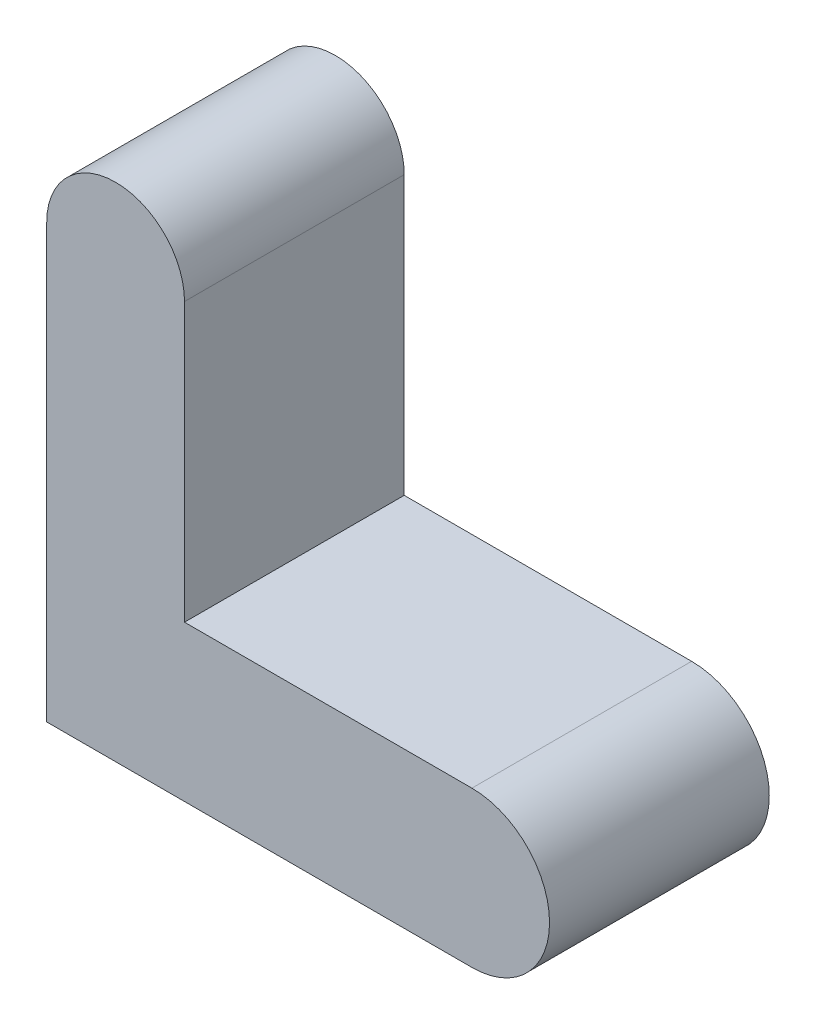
ISO-10303-21;
HEADER;
FILE_DESCRIPTION(('STEP AP214'),'2;1');
FILE_NAME('part.step','',(''),(''),'','','');
FILE_SCHEMA(('AUTOMOTIVE_DESIGN { 1 0 10303 214 1 1 1 1 }'));
ENDSEC;
DATA;
#1=APPLICATION_CONTEXT('core data for automotive mechanical design processes');
#2=APPLICATION_PROTOCOL_DEFINITION('international standard','automotive_design',2000,#1);
#3=PRODUCT_CONTEXT('',#1,'mechanical');
#4=PRODUCT('Part','Part','',(#3));
#5=PRODUCT_RELATED_PRODUCT_CATEGORY('part','',(#4));
#6=PRODUCT_DEFINITION_FORMATION('','',#4);
#7=PRODUCT_DEFINITION_CONTEXT('part definition',#1,'design');
#8=PRODUCT_DEFINITION('design','',#6,#7);
#9=PRODUCT_DEFINITION_SHAPE('','',#8);
#10=(LENGTH_UNIT() NAMED_UNIT(*) SI_UNIT(.MILLI.,.METRE.));
#11=(NAMED_UNIT(*) PLANE_ANGLE_UNIT() SI_UNIT($,.RADIAN.));
#12=(NAMED_UNIT(*) SI_UNIT($,.STERADIAN.) SOLID_ANGLE_UNIT());
#13=UNCERTAINTY_MEASURE_WITH_UNIT(LENGTH_MEASURE(1.E-05),#10,'distance_accuracy_value','');
#14=(GEOMETRIC_REPRESENTATION_CONTEXT(3) GLOBAL_UNCERTAINTY_ASSIGNED_CONTEXT((#13)) GLOBAL_UNIT_ASSIGNED_CONTEXT((#10,
#11,#12)) REPRESENTATION_CONTEXT('',''));
#15=CARTESIAN_POINT('',(0.,0.,0.));
#16=DIRECTION('',(0.,0.,1.));
#17=DIRECTION('',(1.,0.,0.));
#18=AXIS2_PLACEMENT_3D('',#15,#16,#17);
#19=CARTESIAN_POINT('',(45.1262891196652,0.,105.));
#20=DIRECTION('',(0.,0.,-1.));
#21=DIRECTION('',(-1.,0.,0.));
#22=AXIS2_PLACEMENT_3D('',#19,#20,#21);
#23=CYLINDRICAL_SURFACE('',#22,19.4348844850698);
#24=CARTESIAN_POINT('',(45.1262891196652,0.,50.));
#25=DIRECTION('',(0.,0.,1.));
#26=DIRECTION('',(1.,0.,0.));
#27=AXIS2_PLACEMENT_3D('',#24,#25,#26);
#28=CIRCLE('',#27,19.4348844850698);
#29=CARTESIAN_POINT('',(45.1262891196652,-19.4348844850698,50.));
#30=VERTEX_POINT('',#29);
#31=CARTESIAN_POINT('',(45.1262891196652,19.4348844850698,50.));
#32=VERTEX_POINT('',#31);
#33=EDGE_CURVE('E117',#30,#32,#28,.T.);
#34=ORIENTED_EDGE('',*,*,#33,.T.);
#35=DIRECTION('',(0.,0.,-1.));
#36=VECTOR('',#35,1.);
#37=CARTESIAN_POINT('',(45.1262891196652,19.4348844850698,105.));
#38=LINE('',#37,#36);
#39=CARTESIAN_POINT('',(45.1262891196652,19.4348844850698,105.));
#40=VERTEX_POINT('',#39);
#41=EDGE_CURVE('E11',#40,#32,#38,.T.);
#42=ORIENTED_EDGE('',*,*,#41,.F.);
#43=CARTESIAN_POINT('',(45.1262891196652,0.,105.));
#44=DIRECTION('',(0.,0.,1.));
#45=DIRECTION('',(1.,0.,0.));
#46=AXIS2_PLACEMENT_3D('',#43,#44,#45);
#47=CIRCLE('',#46,19.4348844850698);
#48=CARTESIAN_POINT('',(45.1262891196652,-19.4348844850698,105.));
#49=VERTEX_POINT('',#48);
#50=EDGE_CURVE('E127',#49,#40,#47,.T.);
#51=ORIENTED_EDGE('',*,*,#50,.F.);
#52=DIRECTION('',(0.,0.,-1.));
#53=VECTOR('',#52,1.);
#54=CARTESIAN_POINT('',(45.1262891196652,-19.4348844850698,105.));
#55=LINE('',#54,#53);
#56=EDGE_CURVE('E113',#49,#30,#55,.T.);
#57=ORIENTED_EDGE('',*,*,#56,.T.);
#58=EDGE_LOOP('',(#34,#42,#51,#57));
#59=FACE_BOUND('',#58,.T.);
#60=ADVANCED_FACE('F33',(#59),#23,.T.);
#61=CARTESIAN_POINT('',(45.1262891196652,19.4348844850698,105.));
#62=DIRECTION('',(0.,-1.,0.));
#63=DIRECTION('',(1.,0.,0.));
#64=AXIS2_PLACEMENT_3D('',#61,#62,#63);
#65=PLANE('',#64);
#66=DIRECTION('',(-1.,0.,0.));
#67=VECTOR('',#66,1.);
#68=CARTESIAN_POINT('',(45.1262891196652,19.4348844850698,50.));
#69=LINE('',#68,#67);
#70=CARTESIAN_POINT('',(-26.8203416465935,19.4348844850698,50.));
#71=VERTEX_POINT('',#70);
#72=EDGE_CURVE('E120',#32,#71,#69,.T.);
#73=ORIENTED_EDGE('',*,*,#72,.T.);
#74=DIRECTION('',(0.,0.,-1.));
#75=VECTOR('',#74,1.);
#76=CARTESIAN_POINT('',(-26.8203416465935,19.4348844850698,105.));
#77=LINE('',#76,#75);
#78=CARTESIAN_POINT('',(-26.8203416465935,19.4348844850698,105.));
#79=VERTEX_POINT('',#78);
#80=EDGE_CURVE('E41',#79,#71,#77,.T.);
#81=ORIENTED_EDGE('',*,*,#80,.F.);
#82=DIRECTION('',(-1.,0.,0.));
#83=VECTOR('',#82,1.);
#84=CARTESIAN_POINT('',(45.1262891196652,19.4348844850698,105.));
#85=LINE('',#84,#83);
#86=EDGE_CURVE('E86',#40,#79,#85,.T.);
#87=ORIENTED_EDGE('',*,*,#86,.F.);
#88=ORIENTED_EDGE('',*,*,#41,.T.);
#89=EDGE_LOOP('',(#73,#81,#87,#88));
#90=FACE_BOUND('',#89,.T.);
#91=ADVANCED_FACE('F151',(#90),#65,.F.);
#92=CARTESIAN_POINT('',(-26.8203416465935,19.4348844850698,105.));
#93=DIRECTION('',(-1.,0.,0.));
#94=DIRECTION('',(0.,0.,1.));
#95=AXIS2_PLACEMENT_3D('',#92,#93,#94);
#96=PLANE('',#95);
#97=DIRECTION('',(0.,1.,0.));
#98=VECTOR('',#97,1.);
#99=CARTESIAN_POINT('',(-26.8203416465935,19.4348844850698,50.));
#100=LINE('',#99,#98);
#101=CARTESIAN_POINT('',(-26.8203416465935,88.9543759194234,50.));
#102=VERTEX_POINT('',#101);
#103=EDGE_CURVE('E122',#71,#102,#100,.T.);
#104=ORIENTED_EDGE('',*,*,#103,.T.);
#105=DIRECTION('',(0.,0.,-1.));
#106=VECTOR('',#105,1.);
#107=CARTESIAN_POINT('',(-26.8203416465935,88.9543759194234,105.));
#108=LINE('',#107,#106);
#109=CARTESIAN_POINT('',(-26.8203416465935,88.9543759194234,105.));
#110=VERTEX_POINT('',#109);
#111=EDGE_CURVE('E108',#110,#102,#108,.T.);
#112=ORIENTED_EDGE('',*,*,#111,.F.);
#113=DIRECTION('',(0.,1.,0.));
#114=VECTOR('',#113,1.);
#115=CARTESIAN_POINT('',(-26.8203416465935,19.4348844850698,105.));
#116=LINE('',#115,#114);
#117=EDGE_CURVE('E99',#79,#110,#116,.T.);
#118=ORIENTED_EDGE('',*,*,#117,.F.);
#119=ORIENTED_EDGE('',*,*,#80,.T.);
#120=EDGE_LOOP('',(#104,#112,#118,#119));
#121=FACE_BOUND('',#120,.T.);
#122=ADVANCED_FACE('F133',(#121),#96,.F.);
#123=CARTESIAN_POINT('',(-44.061989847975,88.9543759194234,105.));
#124=DIRECTION('',(0.,0.,-1.));
#125=DIRECTION('',(-1.,0.,0.));
#126=AXIS2_PLACEMENT_3D('',#123,#124,#125);
#127=CYLINDRICAL_SURFACE('',#126,17.2416482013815);
#128=CARTESIAN_POINT('',(-44.061989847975,88.9543759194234,50.));
#129=DIRECTION('',(0.,0.,1.));
#130=DIRECTION('',(1.,0.,0.));
#131=AXIS2_PLACEMENT_3D('',#128,#129,#130);
#132=CIRCLE('',#131,17.2416482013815);
#133=CARTESIAN_POINT('',(-61.3036380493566,88.9543759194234,50.));
#134=VERTEX_POINT('',#133);
#135=EDGE_CURVE('E107',#102,#134,#132,.T.);
#136=ORIENTED_EDGE('',*,*,#135,.T.);
#137=DIRECTION('',(0.,0.,-1.));
#138=VECTOR('',#137,1.);
#139=CARTESIAN_POINT('',(-61.3036380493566,88.9543759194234,105.));
#140=LINE('',#139,#138);
#141=CARTESIAN_POINT('',(-61.3036380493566,88.9543759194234,105.));
#142=VERTEX_POINT('',#141);
#143=EDGE_CURVE('E104',#142,#134,#140,.T.);
#144=ORIENTED_EDGE('',*,*,#143,.F.);
#145=CARTESIAN_POINT('',(-44.061989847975,88.9543759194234,105.));
#146=DIRECTION('',(0.,0.,1.));
#147=DIRECTION('',(1.,0.,0.));
#148=AXIS2_PLACEMENT_3D('',#145,#146,#147);
#149=CIRCLE('',#148,17.2416482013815);
#150=EDGE_CURVE('E93',#110,#142,#149,.T.);
#151=ORIENTED_EDGE('',*,*,#150,.F.);
#152=ORIENTED_EDGE('',*,*,#111,.T.);
#153=EDGE_LOOP('',(#136,#144,#151,#152));
#154=FACE_BOUND('',#153,.T.);
#155=ADVANCED_FACE('F105',(#154),#127,.T.);
#156=CARTESIAN_POINT('',(-61.3036380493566,88.9543759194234,105.));
#157=DIRECTION('',(1.,0.,0.));
#158=DIRECTION('',(0.,1.,0.));
#159=AXIS2_PLACEMENT_3D('',#156,#157,#158);
#160=PLANE('',#159);
#161=DIRECTION('',(0.,-1.,0.));
#162=VECTOR('',#161,1.);
#163=CARTESIAN_POINT('',(-61.3036380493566,88.9543759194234,50.));
#164=LINE('',#163,#162);
#165=CARTESIAN_POINT('',(-61.3036380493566,-19.4348844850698,50.));
#166=VERTEX_POINT('',#165);
#167=EDGE_CURVE('E72',#134,#166,#164,.T.);
#168=ORIENTED_EDGE('',*,*,#167,.T.);
#169=DIRECTION('',(0.,0.,-1.));
#170=VECTOR('',#169,1.);
#171=CARTESIAN_POINT('',(-61.3036380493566,-19.4348844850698,105.));
#172=LINE('',#171,#170);
#173=CARTESIAN_POINT('',(-61.3036380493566,-19.4348844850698,105.));
#174=VERTEX_POINT('',#173);
#175=EDGE_CURVE('E109',#174,#166,#172,.T.);
#176=ORIENTED_EDGE('',*,*,#175,.F.);
#177=DIRECTION('',(0.,-1.,0.));
#178=VECTOR('',#177,1.);
#179=CARTESIAN_POINT('',(-61.3036380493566,88.9543759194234,105.));
#180=LINE('',#179,#178);
#181=EDGE_CURVE('E97',#142,#174,#180,.T.);
#182=ORIENTED_EDGE('',*,*,#181,.F.);
#183=ORIENTED_EDGE('',*,*,#143,.T.);
#184=EDGE_LOOP('',(#168,#176,#182,#183));
#185=FACE_BOUND('',#184,.T.);
#186=ADVANCED_FACE('F111',(#185),#160,.F.);
#187=CARTESIAN_POINT('',(-61.3036380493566,-19.4348844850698,105.));
#188=DIRECTION('',(0.,1.,0.));
#189=DIRECTION('',(-1.,0.,0.));
#190=AXIS2_PLACEMENT_3D('',#187,#188,#189);
#191=PLANE('',#190);
#192=DIRECTION('',(1.,0.,0.));
#193=VECTOR('',#192,1.);
#194=CARTESIAN_POINT('',(-61.3036380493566,-19.4348844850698,50.));
#195=LINE('',#194,#193);
#196=EDGE_CURVE('E78',#166,#30,#195,.T.);
#197=ORIENTED_EDGE('',*,*,#196,.T.);
#198=ORIENTED_EDGE('',*,*,#56,.F.);
#199=DIRECTION('',(1.,0.,0.));
#200=VECTOR('',#199,1.);
#201=CARTESIAN_POINT('',(-61.3036380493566,-19.4348844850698,105.));
#202=LINE('',#201,#200);
#203=EDGE_CURVE('E49',#174,#49,#202,.T.);
#204=ORIENTED_EDGE('',*,*,#203,.F.);
#205=ORIENTED_EDGE('',*,*,#175,.T.);
#206=EDGE_LOOP('',(#197,#198,#204,#205));
#207=FACE_BOUND('',#206,.T.);
#208=ADVANCED_FACE('F140',(#207),#191,.F.);
#209=CARTESIAN_POINT('',(45.1262891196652,0.,105.));
#210=DIRECTION('',(0.,0.,1.));
#211=DIRECTION('',(1.,0.,0.));
#212=AXIS2_PLACEMENT_3D('',#209,#210,#211);
#213=PLANE('',#212);
#214=ORIENTED_EDGE('',*,*,#50,.T.);
#215=ORIENTED_EDGE('',*,*,#86,.T.);
#216=ORIENTED_EDGE('',*,*,#117,.T.);
#217=ORIENTED_EDGE('',*,*,#150,.T.);
#218=ORIENTED_EDGE('',*,*,#181,.T.);
#219=ORIENTED_EDGE('',*,*,#203,.T.);
#220=EDGE_LOOP('',(#214,#215,#216,#217,#218,#219));
#221=FACE_BOUND('',#220,.T.);
#222=ADVANCED_FACE('F95',(#221),#213,.T.);
#223=CARTESIAN_POINT('',(45.1262891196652,0.,50.));
#224=DIRECTION('',(0.,0.,1.));
#225=DIRECTION('',(1.,0.,0.));
#226=AXIS2_PLACEMENT_3D('',#223,#224,#225);
#227=PLANE('',#226);
#228=ORIENTED_EDGE('',*,*,#33,.F.);
#229=ORIENTED_EDGE('',*,*,#196,.F.);
#230=ORIENTED_EDGE('',*,*,#167,.F.);
#231=ORIENTED_EDGE('',*,*,#135,.F.);
#232=ORIENTED_EDGE('',*,*,#103,.F.);
#233=ORIENTED_EDGE('',*,*,#72,.F.);
#234=EDGE_LOOP('',(#228,#229,#230,#231,#232,#233));
#235=FACE_BOUND('',#234,.T.);
#236=ADVANCED_FACE('F136',(#235),#227,.F.);
#237=CLOSED_SHELL('',(#60,#91,#122,#155,#186,#208,#222,#236));
#238=MANIFOLD_SOLID_BREP('B2',#237);
#239=ADVANCED_BREP_SHAPE_REPRESENTATION('',(#18,#238),#14);
#240=SHAPE_DEFINITION_REPRESENTATION(#9,#239);
ENDSEC;
END-ISO-10303-21;
